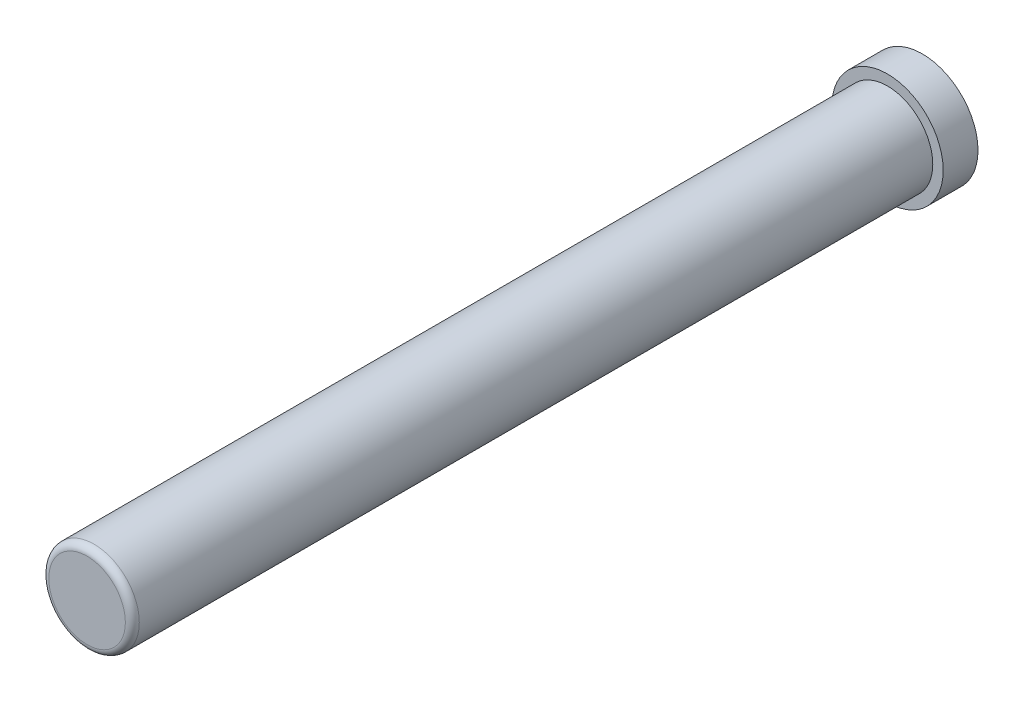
ISO-10303-21;
HEADER;
FILE_DESCRIPTION(('STEP AP214'),'2;1');
FILE_NAME('part.step','',(''),(''),'','','');
FILE_SCHEMA(('AUTOMOTIVE_DESIGN { 1 0 10303 214 1 1 1 1 }'));
ENDSEC;
DATA;
#1=APPLICATION_CONTEXT('core data for automotive mechanical design processes');
#2=APPLICATION_PROTOCOL_DEFINITION('international standard','automotive_design',2000,#1);
#3=PRODUCT_CONTEXT('',#1,'mechanical');
#4=PRODUCT('Part','Part','',(#3));
#5=PRODUCT_RELATED_PRODUCT_CATEGORY('part','',(#4));
#6=PRODUCT_DEFINITION_FORMATION('','',#4);
#7=PRODUCT_DEFINITION_CONTEXT('part definition',#1,'design');
#8=PRODUCT_DEFINITION('design','',#6,#7);
#9=PRODUCT_DEFINITION_SHAPE('','',#8);
#10=(LENGTH_UNIT() NAMED_UNIT(*) SI_UNIT(.MILLI.,.METRE.));
#11=(NAMED_UNIT(*) PLANE_ANGLE_UNIT() SI_UNIT($,.RADIAN.));
#12=(NAMED_UNIT(*) SI_UNIT($,.STERADIAN.) SOLID_ANGLE_UNIT());
#13=UNCERTAINTY_MEASURE_WITH_UNIT(LENGTH_MEASURE(1.E-05),#10,'distance_accuracy_value','');
#14=(GEOMETRIC_REPRESENTATION_CONTEXT(3) GLOBAL_UNCERTAINTY_ASSIGNED_CONTEXT((#13)) GLOBAL_UNIT_ASSIGNED_CONTEXT((#10,
#11,#12)) REPRESENTATION_CONTEXT('',''));
#15=CARTESIAN_POINT('',(0.,0.,0.));
#16=DIRECTION('',(0.,0.,1.));
#17=DIRECTION('',(1.,0.,0.));
#18=AXIS2_PLACEMENT_3D('',#15,#16,#17);
#19=CARTESIAN_POINT('',(0.,0.,5.));
#20=DIRECTION('',(0.,0.,1.));
#21=DIRECTION('',(1.,0.,0.));
#22=AXIS2_PLACEMENT_3D('',#19,#20,#21);
#23=PLANE('',#22);
#24=CARTESIAN_POINT('',(0.,0.,5.));
#25=DIRECTION('',(0.,0.,1.));
#26=DIRECTION('',(1.,0.,0.));
#27=AXIS2_PLACEMENT_3D('',#24,#25,#26);
#28=CIRCLE('',#27,8.);
#29=CARTESIAN_POINT('',(8.,0.,5.));
#30=VERTEX_POINT('',#29);
#31=EDGE_CURVE('E41',#30,#30,#28,.T.);
#32=ORIENTED_EDGE('',*,*,#31,.T.);
#33=EDGE_LOOP('',(#32));
#34=FACE_BOUND('',#33,.T.);
#35=CARTESIAN_POINT('',(0.,0.,5.));
#36=DIRECTION('',(0.,0.,1.));
#37=DIRECTION('',(1.,0.,0.));
#38=AXIS2_PLACEMENT_3D('',#35,#36,#37);
#39=CIRCLE('',#38,6.5);
#40=CARTESIAN_POINT('',(6.5,0.,5.));
#41=VERTEX_POINT('',#40);
#42=EDGE_CURVE('E49',#41,#41,#39,.T.);
#43=ORIENTED_EDGE('',*,*,#42,.F.);
#44=EDGE_LOOP('',(#43));
#45=FACE_BOUND('',#44,.T.);
#46=ADVANCED_FACE('F30',(#34,#45),#23,.T.);
#47=CARTESIAN_POINT('',(0.,0.,5.));
#48=DIRECTION('',(0.,0.,-1.));
#49=DIRECTION('',(-1.,0.,0.));
#50=AXIS2_PLACEMENT_3D('',#47,#48,#49);
#51=CYLINDRICAL_SURFACE('',#50,8.);
#52=ORIENTED_EDGE('',*,*,#31,.F.);
#53=EDGE_LOOP('',(#52));
#54=FACE_BOUND('',#53,.T.);
#55=CARTESIAN_POINT('',(0.,0.,0.));
#56=DIRECTION('',(0.,0.,1.));
#57=DIRECTION('',(1.,0.,0.));
#58=AXIS2_PLACEMENT_3D('',#55,#56,#57);
#59=CIRCLE('',#58,8.);
#60=CARTESIAN_POINT('',(8.,0.,0.));
#61=VERTEX_POINT('',#60);
#62=EDGE_CURVE('E45',#61,#61,#59,.T.);
#63=ORIENTED_EDGE('',*,*,#62,.T.);
#64=EDGE_LOOP('',(#63));
#65=FACE_BOUND('',#64,.T.);
#66=ADVANCED_FACE('F57',(#54,#65),#51,.T.);
#67=CARTESIAN_POINT('',(0.,0.,0.));
#68=DIRECTION('',(0.,0.,1.));
#69=DIRECTION('',(1.,0.,0.));
#70=AXIS2_PLACEMENT_3D('',#67,#68,#69);
#71=PLANE('',#70);
#72=ORIENTED_EDGE('',*,*,#62,.F.);
#73=EDGE_LOOP('',(#72));
#74=FACE_BOUND('',#73,.T.);
#75=ADVANCED_FACE('F63',(#74),#71,.F.);
#76=CARTESIAN_POINT('',(0.,0.,120.));
#77=DIRECTION('',(0.,0.,-1.));
#78=DIRECTION('',(-1.,0.,0.));
#79=AXIS2_PLACEMENT_3D('',#76,#77,#78);
#80=CYLINDRICAL_SURFACE('',#79,6.5);
#81=CARTESIAN_POINT('',(0.,0.,119.));
#82=DIRECTION('',(0.,0.,1.));
#83=DIRECTION('',(1.,0.,0.));
#84=AXIS2_PLACEMENT_3D('',#81,#82,#83);
#85=CIRCLE('',#84,6.5);
#86=CARTESIAN_POINT('',(6.5,0.,119.));
#87=VERTEX_POINT('',#86);
#88=EDGE_CURVE('E10',#87,#87,#85,.F.);
#89=ORIENTED_EDGE('',*,*,#88,.T.);
#90=EDGE_LOOP('',(#89));
#91=FACE_BOUND('',#90,.T.);
#92=ORIENTED_EDGE('',*,*,#42,.T.);
#93=EDGE_LOOP('',(#92));
#94=FACE_BOUND('',#93,.T.);
#95=ADVANCED_FACE('F54',(#91,#94),#80,.T.);
#96=CARTESIAN_POINT('',(0.,0.,120.));
#97=DIRECTION('',(0.,0.,1.));
#98=DIRECTION('',(1.,0.,0.));
#99=AXIS2_PLACEMENT_3D('',#96,#97,#98);
#100=PLANE('',#99);
#101=CARTESIAN_POINT('',(0.,0.,120.));
#102=DIRECTION('',(0.,0.,1.));
#103=DIRECTION('',(1.,0.,0.));
#104=AXIS2_PLACEMENT_3D('',#101,#102,#103);
#105=CIRCLE('',#104,5.5);
#106=CARTESIAN_POINT('',(5.5,0.,120.));
#107=VERTEX_POINT('',#106);
#108=EDGE_CURVE('E37',#107,#107,#105,.T.);
#109=ORIENTED_EDGE('',*,*,#108,.T.);
#110=EDGE_LOOP('',(#109));
#111=FACE_BOUND('',#110,.T.);
#112=ADVANCED_FACE('F73',(#111),#100,.T.);
#113=CARTESIAN_POINT('',(0.,0.,119.));
#114=DIRECTION('',(0.,0.,1.));
#115=DIRECTION('',(1.,0.,0.));
#116=AXIS2_PLACEMENT_3D('',#113,#114,#115);
#117=TOROIDAL_SURFACE('',#116,5.5,1.);
#118=ORIENTED_EDGE('',*,*,#88,.F.);
#119=EDGE_LOOP('',(#118));
#120=FACE_BOUND('',#119,.T.);
#121=ORIENTED_EDGE('',*,*,#108,.F.);
#122=EDGE_LOOP('',(#121));
#123=FACE_BOUND('',#122,.T.);
#124=ADVANCED_FACE('F32',(#120,#123),#117,.T.);
#125=CLOSED_SHELL('',(#46,#66,#75,#95,#112,#124));
#126=MANIFOLD_SOLID_BREP('B2',#125);
#127=ADVANCED_BREP_SHAPE_REPRESENTATION('',(#18,#126),#14);
#128=SHAPE_DEFINITION_REPRESENTATION(#9,#127);
ENDSEC;
END-ISO-10303-21;
